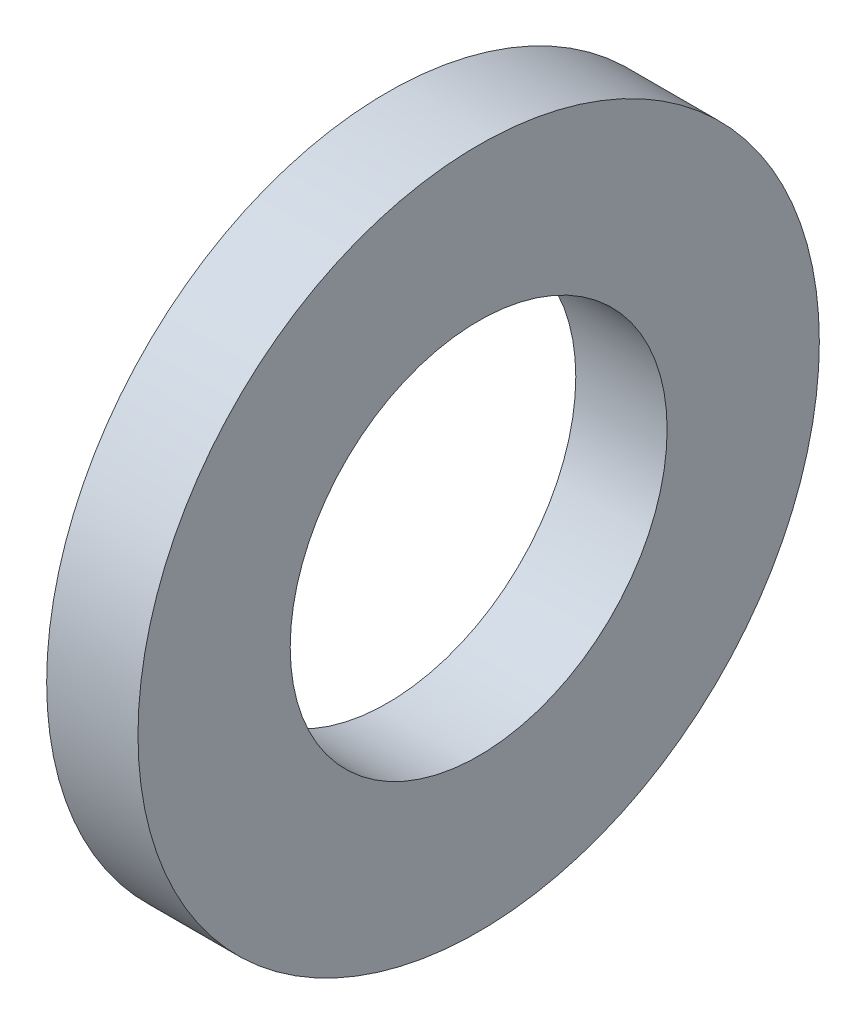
ISO-10303-21;
HEADER;
FILE_DESCRIPTION(('STEP AP214'),'2;1');
FILE_NAME('part.step','',(''),(''),'','','');
FILE_SCHEMA(('AUTOMOTIVE_DESIGN { 1 0 10303 214 1 1 1 1 }'));
ENDSEC;
DATA;
#1=APPLICATION_CONTEXT('core data for automotive mechanical design processes');
#2=APPLICATION_PROTOCOL_DEFINITION('international standard','automotive_design',2000,#1);
#3=PRODUCT_CONTEXT('',#1,'mechanical');
#4=PRODUCT('Part','Part','',(#3));
#5=PRODUCT_RELATED_PRODUCT_CATEGORY('part','',(#4));
#6=PRODUCT_DEFINITION_FORMATION('','',#4);
#7=PRODUCT_DEFINITION_CONTEXT('part definition',#1,'design');
#8=PRODUCT_DEFINITION('design','',#6,#7);
#9=PRODUCT_DEFINITION_SHAPE('','',#8);
#10=(LENGTH_UNIT() NAMED_UNIT(*) SI_UNIT(.MILLI.,.METRE.));
#11=(NAMED_UNIT(*) PLANE_ANGLE_UNIT() SI_UNIT($,.RADIAN.));
#12=(NAMED_UNIT(*) SI_UNIT($,.STERADIAN.) SOLID_ANGLE_UNIT());
#13=UNCERTAINTY_MEASURE_WITH_UNIT(LENGTH_MEASURE(1.E-05),#10,'distance_accuracy_value','');
#14=(GEOMETRIC_REPRESENTATION_CONTEXT(3) GLOBAL_UNCERTAINTY_ASSIGNED_CONTEXT((#13)) GLOBAL_UNIT_ASSIGNED_CONTEXT((#10,
#11,#12)) REPRESENTATION_CONTEXT('',''));
#15=CARTESIAN_POINT('',(0.,0.,0.));
#16=DIRECTION('',(0.,0.,1.));
#17=DIRECTION('',(1.,0.,0.));
#18=AXIS2_PLACEMENT_3D('',#15,#16,#17);
#19=CARTESIAN_POINT('',(-1.6002,5.969,0.));
#20=DIRECTION('',(1.,0.,0.));
#21=DIRECTION('',(0.,0.,-1.));
#22=AXIS2_PLACEMENT_3D('',#19,#20,#21);
#23=PLANE('',#22);
#24=CARTESIAN_POINT('',(-1.6002,0.,0.));
#25=DIRECTION('',(-1.,0.,0.));
#26=DIRECTION('',(0.,0.,1.));
#27=AXIS2_PLACEMENT_3D('',#24,#25,#26);
#28=CIRCLE('',#27,5.969);
#29=CARTESIAN_POINT('',(-1.6002,0.,5.969));
#30=VERTEX_POINT('',#29);
#31=EDGE_CURVE('E18',#30,#30,#28,.F.);
#32=ORIENTED_EDGE('',*,*,#31,.F.);
#33=EDGE_LOOP('',(#32));
#34=FACE_BOUND('',#33,.T.);
#35=CARTESIAN_POINT('',(-1.6002,0.,0.));
#36=DIRECTION('',(-1.,0.,0.));
#37=DIRECTION('',(0.,0.,1.));
#38=AXIS2_PLACEMENT_3D('',#35,#36,#37);
#39=CIRCLE('',#38,3.302);
#40=CARTESIAN_POINT('',(-1.6002,0.,3.302));
#41=VERTEX_POINT('',#40);
#42=EDGE_CURVE('E27',#41,#41,#39,.F.);
#43=ORIENTED_EDGE('',*,*,#42,.T.);
#44=EDGE_LOOP('',(#43));
#45=FACE_BOUND('',#44,.T.);
#46=ADVANCED_FACE('F15',(#34,#45),#23,.F.);
#47=CARTESIAN_POINT('',(-34.9249999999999,0.,0.));
#48=DIRECTION('',(-1.,0.,0.));
#49=DIRECTION('',(0.,0.,1.));
#50=AXIS2_PLACEMENT_3D('',#47,#48,#49);
#51=CYLINDRICAL_SURFACE('',#50,5.969);
#52=ORIENTED_EDGE('',*,*,#31,.T.);
#53=EDGE_LOOP('',(#52));
#54=FACE_BOUND('',#53,.T.);
#55=CARTESIAN_POINT('',(0.,0.,0.));
#56=DIRECTION('',(-1.,0.,0.));
#57=DIRECTION('',(0.,0.,1.));
#58=AXIS2_PLACEMENT_3D('',#55,#56,#57);
#59=CIRCLE('',#58,5.969);
#60=CARTESIAN_POINT('',(0.,0.,5.969));
#61=VERTEX_POINT('',#60);
#62=EDGE_CURVE('E22',#61,#61,#59,.T.);
#63=ORIENTED_EDGE('',*,*,#62,.T.);
#64=EDGE_LOOP('',(#63));
#65=FACE_BOUND('',#64,.T.);
#66=ADVANCED_FACE('F35',(#54,#65),#51,.T.);
#67=CARTESIAN_POINT('',(-34.9249999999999,0.,0.));
#68=DIRECTION('',(-1.,0.,0.));
#69=DIRECTION('',(0.,0.,1.));
#70=AXIS2_PLACEMENT_3D('',#67,#68,#69);
#71=CYLINDRICAL_SURFACE('',#70,3.302);
#72=CARTESIAN_POINT('',(0.,0.,0.));
#73=DIRECTION('',(-1.,0.,0.));
#74=DIRECTION('',(0.,0.,1.));
#75=AXIS2_PLACEMENT_3D('',#72,#73,#74);
#76=CIRCLE('',#75,3.302);
#77=CARTESIAN_POINT('',(0.,0.,3.302));
#78=VERTEX_POINT('',#77);
#79=EDGE_CURVE('E10',#78,#78,#76,.F.);
#80=ORIENTED_EDGE('',*,*,#79,.T.);
#81=EDGE_LOOP('',(#80));
#82=FACE_BOUND('',#81,.T.);
#83=ORIENTED_EDGE('',*,*,#42,.F.);
#84=EDGE_LOOP('',(#83));
#85=FACE_BOUND('',#84,.T.);
#86=ADVANCED_FACE('F43',(#82,#85),#71,.F.);
#87=CARTESIAN_POINT('',(0.,3.302,0.));
#88=DIRECTION('',(-1.,0.,0.));
#89=DIRECTION('',(0.,0.,1.));
#90=AXIS2_PLACEMENT_3D('',#87,#88,#89);
#91=PLANE('',#90);
#92=ORIENTED_EDGE('',*,*,#79,.F.);
#93=EDGE_LOOP('',(#92));
#94=FACE_BOUND('',#93,.T.);
#95=ORIENTED_EDGE('',*,*,#62,.F.);
#96=EDGE_LOOP('',(#95));
#97=FACE_BOUND('',#96,.T.);
#98=ADVANCED_FACE('F44',(#94,#97),#91,.F.);
#99=CLOSED_SHELL('',(#46,#66,#86,#98));
#100=MANIFOLD_SOLID_BREP('B1',#99);
#101=ADVANCED_BREP_SHAPE_REPRESENTATION('',(#18,#100),#14);
#102=SHAPE_DEFINITION_REPRESENTATION(#9,#101);
ENDSEC;
END-ISO-10303-21;
